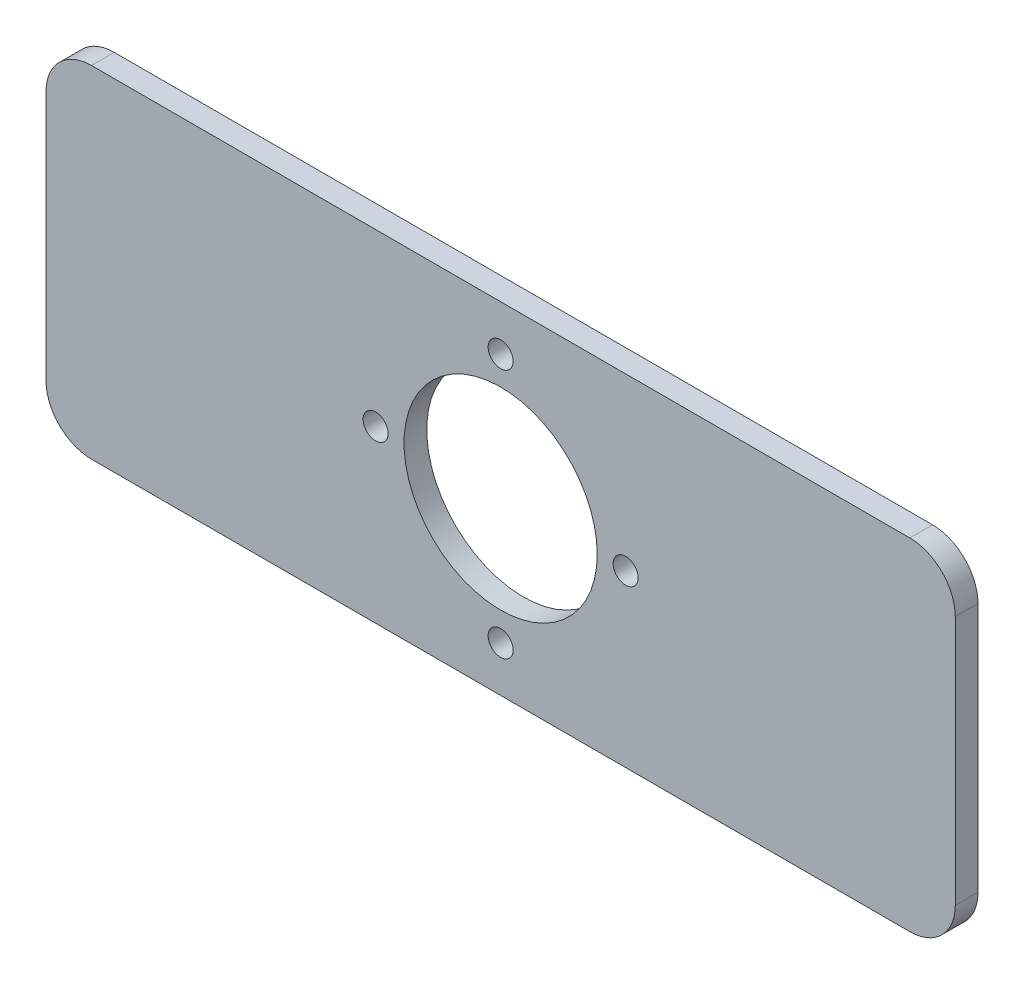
from build123d import *

# Parameters (mm, degrees)
ESQUISSE1_R          = 42.5
ESQUISSE1_R_2        = 5.5
BASE_EXTRUSION_DEPTH = 10


with BuildPart() as part:
    # Esquisse1 → Base-Extrusion (new body)
    with BuildSketch(Plane.XY):
        with BuildLine():
            Line((20, 0), (380, 0))
            ThreePointArc((380, 0), (394.142135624, -5.857864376), (400, -20))
            Line((400, -20), (400, -130))
            ThreePointArc((400, -130), (394.142135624, -144.142135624), (380, -150))
            Line((380, -150), (20, -150))
            ThreePointArc((20, -150), (5.857864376, -144.142135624), (0, -130))
            Line((0, -130), (0, -20))
            ThreePointArc((0, -20), (5.857864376, -5.857864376), (20, 0))
        make_face()
        with Locations((200, -75)):
            Circle(ESQUISSE1_R, mode=Mode.SUBTRACT)
        with Locations((200, -20)):
            Circle(ESQUISSE1_R_2, mode=Mode.SUBTRACT)
        with Locations((255, -75)):
            Circle(ESQUISSE1_R_2, mode=Mode.SUBTRACT)
        with Locations((200, -130)):
            Circle(ESQUISSE1_R_2, mode=Mode.SUBTRACT)
        with Locations((145, -75)):
            Circle(ESQUISSE1_R_2, mode=Mode.SUBTRACT)
    extrude(amount=BASE_EXTRUSION_DEPTH)


solid = part.part
